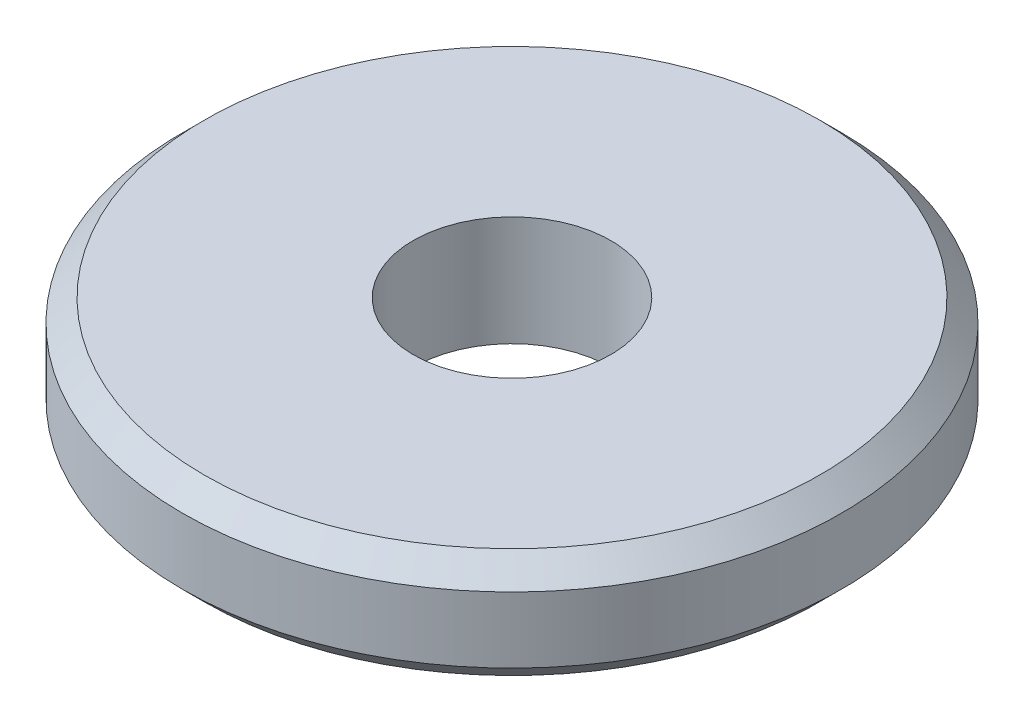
ISO-10303-21;
HEADER;
FILE_DESCRIPTION(('STEP AP214'),'2;1');
FILE_NAME('part.step','',(''),(''),'','','');
FILE_SCHEMA(('AUTOMOTIVE_DESIGN { 1 0 10303 214 1 1 1 1 }'));
ENDSEC;
DATA;
#1=APPLICATION_CONTEXT('core data for automotive mechanical design processes');
#2=APPLICATION_PROTOCOL_DEFINITION('international standard','automotive_design',2000,#1);
#3=PRODUCT_CONTEXT('',#1,'mechanical');
#4=PRODUCT('Part','Part','',(#3));
#5=PRODUCT_RELATED_PRODUCT_CATEGORY('part','',(#4));
#6=PRODUCT_DEFINITION_FORMATION('','',#4);
#7=PRODUCT_DEFINITION_CONTEXT('part definition',#1,'design');
#8=PRODUCT_DEFINITION('design','',#6,#7);
#9=PRODUCT_DEFINITION_SHAPE('','',#8);
#10=(LENGTH_UNIT() NAMED_UNIT(*) SI_UNIT(.MILLI.,.METRE.));
#11=(NAMED_UNIT(*) PLANE_ANGLE_UNIT() SI_UNIT($,.RADIAN.));
#12=(NAMED_UNIT(*) SI_UNIT($,.STERADIAN.) SOLID_ANGLE_UNIT());
#13=UNCERTAINTY_MEASURE_WITH_UNIT(LENGTH_MEASURE(1.E-05),#10,'distance_accuracy_value','');
#14=(GEOMETRIC_REPRESENTATION_CONTEXT(3) GLOBAL_UNCERTAINTY_ASSIGNED_CONTEXT((#13)) GLOBAL_UNIT_ASSIGNED_CONTEXT((#10,
#11,#12)) REPRESENTATION_CONTEXT('',''));
#15=CARTESIAN_POINT('',(0.,0.,0.));
#16=DIRECTION('',(0.,0.,1.));
#17=DIRECTION('',(1.,0.,0.));
#18=AXIS2_PLACEMENT_3D('',#15,#16,#17);
#19=CARTESIAN_POINT('',(0.,5.,0.));
#20=DIRECTION('',(0.,1.,0.));
#21=DIRECTION('',(0.,0.,1.));
#22=AXIS2_PLACEMENT_3D('',#19,#20,#21);
#23=PLANE('',#22);
#24=CARTESIAN_POINT('',(0.,5.,0.));
#25=DIRECTION('',(0.,1.,0.));
#26=DIRECTION('',(0.,0.,1.));
#27=AXIS2_PLACEMENT_3D('',#24,#25,#26);
#28=CIRCLE('',#27,14.);
#29=CARTESIAN_POINT('',(0.,5.,14.));
#30=VERTEX_POINT('',#29);
#31=EDGE_CURVE('E10',#30,#30,#28,.T.);
#32=ORIENTED_EDGE('',*,*,#31,.T.);
#33=EDGE_LOOP('',(#32));
#34=FACE_BOUND('',#33,.T.);
#35=CARTESIAN_POINT('',(0.,5.,0.));
#36=DIRECTION('',(0.,1.,0.));
#37=DIRECTION('',(0.,0.,1.));
#38=AXIS2_PLACEMENT_3D('',#35,#36,#37);
#39=CIRCLE('',#38,4.5);
#40=CARTESIAN_POINT('',(0.,5.,4.5));
#41=VERTEX_POINT('',#40);
#42=EDGE_CURVE('E49',#41,#41,#39,.T.);
#43=ORIENTED_EDGE('',*,*,#42,.F.);
#44=EDGE_LOOP('',(#43));
#45=FACE_BOUND('',#44,.T.);
#46=ADVANCED_FACE('F29',(#34,#45),#23,.T.);
#47=CARTESIAN_POINT('',(0.,0.,0.));
#48=DIRECTION('',(0.,1.,0.));
#49=DIRECTION('',(0.,0.,1.));
#50=AXIS2_PLACEMENT_3D('',#47,#48,#49);
#51=PLANE('',#50);
#52=CARTESIAN_POINT('',(0.,0.,0.));
#53=DIRECTION('',(0.,1.,0.));
#54=DIRECTION('',(0.,0.,1.));
#55=AXIS2_PLACEMENT_3D('',#52,#53,#54);
#56=CIRCLE('',#55,14.);
#57=CARTESIAN_POINT('',(0.,0.,14.));
#58=VERTEX_POINT('',#57);
#59=EDGE_CURVE('E36',#58,#58,#56,.F.);
#60=ORIENTED_EDGE('',*,*,#59,.T.);
#61=EDGE_LOOP('',(#60));
#62=FACE_BOUND('',#61,.T.);
#63=CARTESIAN_POINT('',(0.,0.,0.));
#64=DIRECTION('',(0.,1.,0.));
#65=DIRECTION('',(0.,0.,1.));
#66=AXIS2_PLACEMENT_3D('',#63,#64,#65);
#67=CIRCLE('',#66,4.5);
#68=CARTESIAN_POINT('',(0.,0.,4.5));
#69=VERTEX_POINT('',#68);
#70=EDGE_CURVE('E50',#69,#69,#67,.T.);
#71=ORIENTED_EDGE('',*,*,#70,.T.);
#72=EDGE_LOOP('',(#71));
#73=FACE_BOUND('',#72,.T.);
#74=ADVANCED_FACE('F60',(#62,#73),#51,.F.);
#75=CARTESIAN_POINT('',(0.,5.,0.));
#76=DIRECTION('',(0.,-1.,0.));
#77=DIRECTION('',(0.,0.,-1.));
#78=AXIS2_PLACEMENT_3D('',#75,#76,#77);
#79=CYLINDRICAL_SURFACE('',#78,15.);
#80=CARTESIAN_POINT('',(0.,0.999999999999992,0.));
#81=DIRECTION('',(0.,1.,0.));
#82=DIRECTION('',(0.,0.,1.));
#83=AXIS2_PLACEMENT_3D('',#80,#81,#82);
#84=CIRCLE('',#83,15.);
#85=CARTESIAN_POINT('',(0.,0.999999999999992,15.));
#86=VERTEX_POINT('',#85);
#87=EDGE_CURVE('E40',#86,#86,#84,.T.);
#88=ORIENTED_EDGE('',*,*,#87,.T.);
#89=EDGE_LOOP('',(#88));
#90=FACE_BOUND('',#89,.T.);
#91=CARTESIAN_POINT('',(0.,4.,0.));
#92=DIRECTION('',(0.,1.,0.));
#93=DIRECTION('',(0.,0.,1.));
#94=AXIS2_PLACEMENT_3D('',#91,#92,#93);
#95=CIRCLE('',#94,15.);
#96=CARTESIAN_POINT('',(0.,4.,15.));
#97=VERTEX_POINT('',#96);
#98=EDGE_CURVE('E44',#97,#97,#95,.F.);
#99=ORIENTED_EDGE('',*,*,#98,.T.);
#100=EDGE_LOOP('',(#99));
#101=FACE_BOUND('',#100,.T.);
#102=ADVANCED_FACE('F65',(#90,#101),#79,.T.);
#103=CARTESIAN_POINT('',(0.,5.,0.));
#104=DIRECTION('',(0.,-1.,0.));
#105=DIRECTION('',(0.,0.,-1.));
#106=AXIS2_PLACEMENT_3D('',#103,#104,#105);
#107=CYLINDRICAL_SURFACE('',#106,4.5);
#108=ORIENTED_EDGE('',*,*,#42,.T.);
#109=EDGE_LOOP('',(#108));
#110=FACE_BOUND('',#109,.T.);
#111=ORIENTED_EDGE('',*,*,#70,.F.);
#112=EDGE_LOOP('',(#111));
#113=FACE_BOUND('',#112,.T.);
#114=ADVANCED_FACE('F56',(#110,#113),#107,.F.);
#115=CARTESIAN_POINT('',(0.,0.999999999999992,0.));
#116=DIRECTION('',(0.,1.,0.));
#117=DIRECTION('',(0.,0.,1.));
#118=AXIS2_PLACEMENT_3D('',#115,#116,#117);
#119=CONICAL_SURFACE('',#118,15.,0.78539816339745);
#120=ORIENTED_EDGE('',*,*,#59,.F.);
#121=EDGE_LOOP('',(#120));
#122=FACE_BOUND('',#121,.T.);
#123=ORIENTED_EDGE('',*,*,#87,.F.);
#124=EDGE_LOOP('',(#123));
#125=FACE_BOUND('',#124,.T.);
#126=ADVANCED_FACE('F71',(#122,#125),#119,.T.);
#127=CARTESIAN_POINT('',(0.,5.,0.));
#128=DIRECTION('',(0.,-1.,0.));
#129=DIRECTION('',(0.,0.,-1.));
#130=AXIS2_PLACEMENT_3D('',#127,#128,#129);
#131=CONICAL_SURFACE('',#130,14.,0.785398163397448);
#132=ORIENTED_EDGE('',*,*,#98,.F.);
#133=EDGE_LOOP('',(#132));
#134=FACE_BOUND('',#133,.T.);
#135=ORIENTED_EDGE('',*,*,#31,.F.);
#136=EDGE_LOOP('',(#135));
#137=FACE_BOUND('',#136,.T.);
#138=ADVANCED_FACE('F31',(#134,#137),#131,.T.);
#139=CLOSED_SHELL('',(#46,#74,#102,#114,#126,#138));
#140=MANIFOLD_SOLID_BREP('B2',#139);
#141=ADVANCED_BREP_SHAPE_REPRESENTATION('',(#18,#140),#14);
#142=SHAPE_DEFINITION_REPRESENTATION(#9,#141);
ENDSEC;
END-ISO-10303-21;
